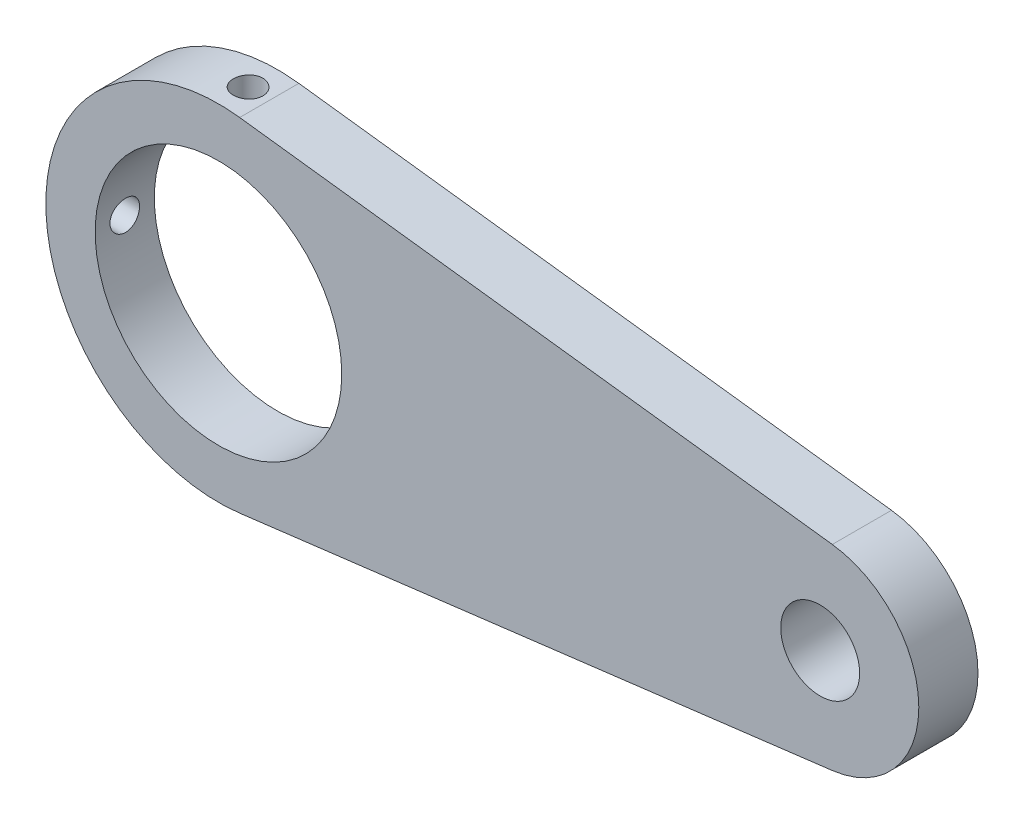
ISO-10303-21;
HEADER;
FILE_DESCRIPTION(('STEP AP214'),'2;1');
FILE_NAME('part.step','',(''),(''),'','','');
FILE_SCHEMA(('AUTOMOTIVE_DESIGN { 1 0 10303 214 1 1 1 1 }'));
ENDSEC;
DATA;
#1=APPLICATION_CONTEXT('core data for automotive mechanical design processes');
#2=APPLICATION_PROTOCOL_DEFINITION('international standard','automotive_design',2000,#1);
#3=PRODUCT_CONTEXT('',#1,'mechanical');
#4=PRODUCT('Part','Part','',(#3));
#5=PRODUCT_RELATED_PRODUCT_CATEGORY('part','',(#4));
#6=PRODUCT_DEFINITION_FORMATION('','',#4);
#7=PRODUCT_DEFINITION_CONTEXT('part definition',#1,'design');
#8=PRODUCT_DEFINITION('design','',#6,#7);
#9=PRODUCT_DEFINITION_SHAPE('','',#8);
#10=(LENGTH_UNIT() NAMED_UNIT(*) SI_UNIT(.MILLI.,.METRE.));
#11=(NAMED_UNIT(*) PLANE_ANGLE_UNIT() SI_UNIT($,.RADIAN.));
#12=(NAMED_UNIT(*) SI_UNIT($,.STERADIAN.) SOLID_ANGLE_UNIT());
#13=UNCERTAINTY_MEASURE_WITH_UNIT(LENGTH_MEASURE(1.E-05),#10,'distance_accuracy_value','');
#14=(GEOMETRIC_REPRESENTATION_CONTEXT(3) GLOBAL_UNCERTAINTY_ASSIGNED_CONTEXT((#13)) GLOBAL_UNIT_ASSIGNED_CONTEXT((#10,
#11,#12)) REPRESENTATION_CONTEXT('',''));
#15=CARTESIAN_POINT('',(0.,0.,0.));
#16=DIRECTION('',(0.,0.,1.));
#17=DIRECTION('',(1.,0.,0.));
#18=AXIS2_PLACEMENT_3D('',#15,#16,#17);
#19=CARTESIAN_POINT('',(0.,0.,12.));
#20=DIRECTION('',(0.,0.,-1.));
#21=DIRECTION('',(-1.,0.,0.));
#22=AXIS2_PLACEMENT_3D('',#19,#20,#21);
#23=CYLINDRICAL_SURFACE('',#22,35.);
#24=CARTESIAN_POINT('',(0.,35.,9.));
#25=CARTESIAN_POINT('',(-0.168180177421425,34.9999983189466,8.99999266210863));
#26=CARTESIAN_POINT('',(-0.336474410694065,34.9987748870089,8.98581013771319));
#27=CARTESIAN_POINT('',(-0.668405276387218,34.9940120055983,8.92944276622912));
#28=CARTESIAN_POINT('',(-0.832036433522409,34.9904699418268,8.8872263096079));
#29=CARTESIAN_POINT('',(-1.14978580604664,34.9814700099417,8.77602193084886));
#30=CARTESIAN_POINT('',(-1.30390939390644,34.9760132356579,8.70704929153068));
#31=CARTESIAN_POINT('',(-1.5983553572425,34.9637955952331,8.54431808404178));
#32=CARTESIAN_POINT('',(-1.7386806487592,34.95703500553,8.45056476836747));
#33=CARTESIAN_POINT('',(-2.00196024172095,34.9429478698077,8.2406617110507));
#34=CARTESIAN_POINT('',(-2.12487233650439,34.9356200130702,8.12445911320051));
#35=CARTESIAN_POINT('',(-2.34947428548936,34.9212352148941,7.87306791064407));
#36=CARTESIAN_POINT('',(-2.45116320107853,34.9141782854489,7.73787846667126));
#37=CARTESIAN_POINT('',(-2.63057608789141,34.901120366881,7.45209423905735));
#38=CARTESIAN_POINT('',(-2.7082627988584,34.895121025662,7.30147598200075));
#39=CARTESIAN_POINT('',(-2.83722803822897,34.8848727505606,6.98927310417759));
#40=CARTESIAN_POINT('',(-2.88850705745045,34.8806237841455,6.82768868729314));
#41=CARTESIAN_POINT('',(-2.96307845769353,34.8743684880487,6.49856435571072));
#42=CARTESIAN_POINT('',(-2.98643979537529,34.8723566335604,6.33104017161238));
#43=CARTESIAN_POINT('',(-3.00472573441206,34.8707859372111,5.99443731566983));
#44=CARTESIAN_POINT('',(-2.99965089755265,34.8712270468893,5.82535867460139));
#45=CARTESIAN_POINT('',(-2.96126551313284,34.874507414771,5.49091935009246));
#46=CARTESIAN_POINT('',(-2.9280299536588,34.8773403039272,5.32554998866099));
#47=CARTESIAN_POINT('',(-2.83438308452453,34.8850750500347,5.00274549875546));
#48=CARTESIAN_POINT('',(-2.77397149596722,34.8899769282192,4.84531045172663));
#49=CARTESIAN_POINT('',(-2.62760362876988,34.9013046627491,4.54260489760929));
#50=CARTESIAN_POINT('',(-2.54161375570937,34.9077325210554,4.39735071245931));
#51=CARTESIAN_POINT('',(-2.34655446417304,34.9213861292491,4.12330862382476));
#52=CARTESIAN_POINT('',(-2.23748455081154,34.9286118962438,3.99452107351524));
#53=CARTESIAN_POINT('',(-1.99894091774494,34.9430754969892,3.75663207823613));
#54=CARTESIAN_POINT('',(-1.86940237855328,34.9503132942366,3.64759561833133));
#55=CARTESIAN_POINT('',(-1.59382461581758,34.9639632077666,3.45280656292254));
#56=CARTESIAN_POINT('',(-1.44778538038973,34.9703753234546,3.36705398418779));
#57=CARTESIAN_POINT('',(-1.1433091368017,34.9816527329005,3.2212707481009));
#58=CARTESIAN_POINT('',(-0.984870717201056,34.9865178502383,3.16124302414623));
#59=CARTESIAN_POINT('',(-0.660113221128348,34.9941511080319,3.06865924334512));
#60=CARTESIAN_POINT('',(-0.493794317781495,34.9969192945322,3.03610258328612));
#61=CARTESIAN_POINT('',(-0.158560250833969,35.0000408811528,2.99946669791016));
#62=CARTESIAN_POINT('',(0.0103450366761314,35.0004018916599,2.99529772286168));
#63=CARTESIAN_POINT('',(0.34645210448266,34.9986887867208,3.01532035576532));
#64=CARTESIAN_POINT('',(0.513653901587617,34.9966146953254,3.03951168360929));
#65=CARTESIAN_POINT('',(0.841351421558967,34.9902695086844,3.11549382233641));
#66=CARTESIAN_POINT('',(1.00185687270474,34.9860017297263,3.16724297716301));
#67=CARTESIAN_POINT('',(1.31190702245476,34.9757485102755,3.29682922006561));
#68=CARTESIAN_POINT('',(1.46145153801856,34.9697630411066,3.37466674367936));
#69=CARTESIAN_POINT('',(1.7457428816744,34.9567262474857,3.55444535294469));
#70=CARTESIAN_POINT('',(1.88045202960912,34.9496723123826,3.65644583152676));
#71=CARTESIAN_POINT('',(2.13086824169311,34.9352996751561,3.88156921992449));
#72=CARTESIAN_POINT('',(2.24657495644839,34.9279809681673,4.00469251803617));
#73=CARTESIAN_POINT('',(2.45601016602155,34.9138810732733,4.26895626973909));
#74=CARTESIAN_POINT('',(2.54968004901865,34.9071013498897,4.41014326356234));
#75=CARTESIAN_POINT('',(2.71198063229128,34.8948680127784,4.70629524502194));
#76=CARTESIAN_POINT('',(2.78061159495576,34.8894143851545,4.8612600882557));
#77=CARTESIAN_POINT('',(2.8907865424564,34.8804590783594,5.18036221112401));
#78=CARTESIAN_POINT('',(2.93236627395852,34.8769548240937,5.34448707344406));
#79=CARTESIAN_POINT('',(2.98737479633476,34.872286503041,5.67742005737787));
#80=CARTESIAN_POINT('',(3.0008041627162,34.871122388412,5.84622808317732));
#81=CARTESIAN_POINT('',(2.99912392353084,34.8712668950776,6.18315306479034));
#82=CARTESIAN_POINT('',(2.98410640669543,34.8725675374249,6.35127049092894));
#83=CARTESIAN_POINT('',(2.92615085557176,34.8774780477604,6.68258592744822));
#84=CARTESIAN_POINT('',(2.88321277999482,34.8810879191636,6.84578393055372));
#85=CARTESIAN_POINT('',(2.7706585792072,34.8902080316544,7.16263302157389));
#86=CARTESIAN_POINT('',(2.70104425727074,34.8957181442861,7.3162847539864));
#87=CARTESIAN_POINT('',(2.53712384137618,34.9080181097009,7.60973557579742));
#88=CARTESIAN_POINT('',(2.4428181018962,34.9148079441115,7.74953486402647));
#89=CARTESIAN_POINT('',(2.23184571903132,34.9289284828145,8.01178384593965));
#90=CARTESIAN_POINT('',(2.11511080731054,34.9362607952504,8.13417853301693));
#91=CARTESIAN_POINT('',(1.86271960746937,34.9506254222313,8.357688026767));
#92=CARTESIAN_POINT('',(1.72705875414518,34.9576576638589,8.45879768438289));
#93=CARTESIAN_POINT('',(1.44039065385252,34.9706432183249,8.63701082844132));
#94=CARTESIAN_POINT('',(1.28935405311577,34.9765944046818,8.71406721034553));
#95=CARTESIAN_POINT('',(0.976537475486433,34.9867226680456,8.84162677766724));
#96=CARTESIAN_POINT('',(0.81477005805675,34.9909017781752,8.89216040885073));
#97=CARTESIAN_POINT('',(0.543377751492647,34.9959451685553,8.95240549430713));
#98=CARTESIAN_POINT('',(0.435496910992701,34.9974587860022,8.97022962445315));
#99=CARTESIAN_POINT('',(0.218426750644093,34.9994867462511,8.99402924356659));
#100=CARTESIAN_POINT('',(0.109237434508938,35.0000010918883,9.00000476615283));
#101=CARTESIAN_POINT('',(0.,35.,9.));
#102=B_SPLINE_CURVE_WITH_KNOTS('',3,(#24,#25,#26,#27,#28,#29,#30,#31,#32,#33,#34,#35,#36,#37,
#38,#39,#40,#41,#42,#43,#44,#45,#46,#47,#48,#49,#50,#51,#52,#53,#54,#55,#56,#57,#58,#59,#60,#61,
#62,#63,#64,#65,#66,#67,#68,#69,#70,#71,#72,#73,#74,#75,#76,#77,#78,#79,#80,#81,#82,#83,#84,#85,
#86,#87,#88,#89,#90,#91,#92,#93,#94,#95,#96,#97,#98,#99,#100,#101),.UNSPECIFIED.,.T.,.F.,(4,2,2,
2,2,2,2,2,2,2,2,2,2,2,2,2,2,2,2,2,2,2,2,2,2,2,2,2,2,2,2,2,2,2,2,2,2,2,4),(0.,0.504141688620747,
1.00885278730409,1.51327602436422,2.01759242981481,2.5231110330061,3.02865198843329,
3.53497383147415,4.04128626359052,4.54634550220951,5.05139476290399,5.55510335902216,
6.05881712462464,6.56319540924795,7.06758450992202,7.57360414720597,8.07962414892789,
8.58570183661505,9.09176841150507,9.59623427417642,10.1006951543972,10.6043956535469,
11.1081045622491,11.6130646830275,12.1180340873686,12.6243317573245,13.1306241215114,
13.636246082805,14.1418577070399,14.6458353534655,15.1498137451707,15.6537580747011,
16.1576951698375,16.6631911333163,17.1688092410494,17.6754113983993,18.1814307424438,
18.5088849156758,18.8363381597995),.UNSPECIFIED.);
#103=CARTESIAN_POINT('',(0.,35.,9.));
#104=VERTEX_POINT('',#103);
#105=EDGE_CURVE('E121',#104,#104,#102,.T.);
#106=ORIENTED_EDGE('',*,*,#105,.T.);
#107=EDGE_LOOP('',(#106));
#108=FACE_BOUND('',#107,.T.);
#109=CARTESIAN_POINT('',(0.,0.,0.));
#110=DIRECTION('',(0.,0.,1.));
#111=DIRECTION('',(1.,0.,0.));
#112=AXIS2_PLACEMENT_3D('',#109,#110,#111);
#113=CIRCLE('',#112,35.);
#114=CARTESIAN_POINT('',(4.3032786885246,34.7344467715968,0.));
#115=VERTEX_POINT('',#114);
#116=CARTESIAN_POINT('',(4.30327868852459,-34.7344467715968,0.));
#117=VERTEX_POINT('',#116);
#118=EDGE_CURVE('E108',#115,#117,#113,.T.);
#119=ORIENTED_EDGE('',*,*,#118,.T.);
#120=DIRECTION('',(0.,0.,-1.));
#121=VECTOR('',#120,1.);
#122=CARTESIAN_POINT('',(4.30327868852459,-34.7344467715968,12.));
#123=LINE('',#122,#121);
#124=CARTESIAN_POINT('',(4.30327868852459,-34.7344467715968,12.));
#125=VERTEX_POINT('',#124);
#126=EDGE_CURVE('E11',#125,#117,#123,.T.);
#127=ORIENTED_EDGE('',*,*,#126,.F.);
#128=CARTESIAN_POINT('',(0.,0.,12.));
#129=DIRECTION('',(0.,0.,1.));
#130=DIRECTION('',(1.,0.,0.));
#131=AXIS2_PLACEMENT_3D('',#128,#129,#130);
#132=CIRCLE('',#131,35.);
#133=CARTESIAN_POINT('',(4.3032786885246,34.7344467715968,12.));
#134=VERTEX_POINT('',#133);
#135=EDGE_CURVE('E95',#134,#125,#132,.T.);
#136=ORIENTED_EDGE('',*,*,#135,.F.);
#137=DIRECTION('',(0.,0.,-1.));
#138=VECTOR('',#137,1.);
#139=CARTESIAN_POINT('',(4.3032786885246,34.7344467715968,12.));
#140=LINE('',#139,#138);
#141=EDGE_CURVE('E104',#134,#115,#140,.T.);
#142=ORIENTED_EDGE('',*,*,#141,.T.);
#143=EDGE_LOOP('',(#119,#127,#136,#142));
#144=FACE_BOUND('',#143,.T.);
#145=CARTESIAN_POINT('',(-35.,0.,9.));
#146=CARTESIAN_POINT('',(-34.9999983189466,0.168180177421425,8.99999266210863));
#147=CARTESIAN_POINT('',(-34.9987748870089,0.336474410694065,8.98581013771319));
#148=CARTESIAN_POINT('',(-34.9940120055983,0.668405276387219,8.92944276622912));
#149=CARTESIAN_POINT('',(-34.9904699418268,0.83203643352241,8.8872263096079));
#150=CARTESIAN_POINT('',(-34.9814700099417,1.14978580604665,8.77602193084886));
#151=CARTESIAN_POINT('',(-34.9760132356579,1.30390939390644,8.70704929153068));
#152=CARTESIAN_POINT('',(-34.9637955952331,1.5983553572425,8.54431808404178));
#153=CARTESIAN_POINT('',(-34.95703500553,1.7386806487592,8.45056476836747));
#154=CARTESIAN_POINT('',(-34.9429478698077,2.00196024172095,8.2406617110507));
#155=CARTESIAN_POINT('',(-34.9356200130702,2.12487233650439,8.12445911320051));
#156=CARTESIAN_POINT('',(-34.9212352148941,2.34947428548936,7.87306791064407));
#157=CARTESIAN_POINT('',(-34.9141782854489,2.45116320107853,7.73787846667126));
#158=CARTESIAN_POINT('',(-34.901120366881,2.63057608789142,7.45209423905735));
#159=CARTESIAN_POINT('',(-34.895121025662,2.70826279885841,7.30147598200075));
#160=CARTESIAN_POINT('',(-34.8848727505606,2.83722803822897,6.98927310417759));
#161=CARTESIAN_POINT('',(-34.8806237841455,2.88850705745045,6.82768868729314));
#162=CARTESIAN_POINT('',(-34.8743684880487,2.96307845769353,6.49856435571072));
#163=CARTESIAN_POINT('',(-34.8723566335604,2.98643979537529,6.33104017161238));
#164=CARTESIAN_POINT('',(-34.8707859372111,3.00472573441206,5.99443731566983));
#165=CARTESIAN_POINT('',(-34.8712270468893,2.99965089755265,5.82535867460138));
#166=CARTESIAN_POINT('',(-34.874507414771,2.96126551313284,5.49091935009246));
#167=CARTESIAN_POINT('',(-34.8773403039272,2.92802995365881,5.32554998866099));
#168=CARTESIAN_POINT('',(-34.8850750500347,2.83438308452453,5.00274549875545));
#169=CARTESIAN_POINT('',(-34.8899769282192,2.77397149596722,4.84531045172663));
#170=CARTESIAN_POINT('',(-34.9013046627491,2.62760362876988,4.54260489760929));
#171=CARTESIAN_POINT('',(-34.9077325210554,2.54161375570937,4.39735071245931));
#172=CARTESIAN_POINT('',(-34.9213861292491,2.34655446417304,4.12330862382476));
#173=CARTESIAN_POINT('',(-34.9286118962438,2.23748455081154,3.99452107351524));
#174=CARTESIAN_POINT('',(-34.9430754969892,1.99894091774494,3.75663207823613));
#175=CARTESIAN_POINT('',(-34.9503132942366,1.86940237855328,3.64759561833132));
#176=CARTESIAN_POINT('',(-34.9639632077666,1.59382461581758,3.45280656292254));
#177=CARTESIAN_POINT('',(-34.9703753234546,1.44778538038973,3.36705398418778));
#178=CARTESIAN_POINT('',(-34.9816527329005,1.1433091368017,3.2212707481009));
#179=CARTESIAN_POINT('',(-34.9865178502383,0.984870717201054,3.16124302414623));
#180=CARTESIAN_POINT('',(-34.9941511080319,0.660113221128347,3.06865924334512));
#181=CARTESIAN_POINT('',(-34.9969192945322,0.493794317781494,3.03610258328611));
#182=CARTESIAN_POINT('',(-35.0000408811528,0.158560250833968,2.99946669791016));
#183=CARTESIAN_POINT('',(-35.0004018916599,-0.0103450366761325,2.99529772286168));
#184=CARTESIAN_POINT('',(-34.9986887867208,-0.346452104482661,3.01532035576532));
#185=CARTESIAN_POINT('',(-34.9966146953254,-0.513653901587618,3.03951168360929));
#186=CARTESIAN_POINT('',(-34.9902695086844,-0.841351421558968,3.11549382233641));
#187=CARTESIAN_POINT('',(-34.9860017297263,-1.00185687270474,3.16724297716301));
#188=CARTESIAN_POINT('',(-34.9757485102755,-1.31190702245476,3.29682922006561));
#189=CARTESIAN_POINT('',(-34.9697630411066,-1.46145153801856,3.37466674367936));
#190=CARTESIAN_POINT('',(-34.9567262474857,-1.7457428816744,3.55444535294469));
#191=CARTESIAN_POINT('',(-34.9496723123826,-1.88045202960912,3.65644583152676));
#192=CARTESIAN_POINT('',(-34.9352996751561,-2.13086824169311,3.88156921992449));
#193=CARTESIAN_POINT('',(-34.9279809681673,-2.2465749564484,4.00469251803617));
#194=CARTESIAN_POINT('',(-34.9138810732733,-2.45601016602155,4.26895626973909));
#195=CARTESIAN_POINT('',(-34.9071013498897,-2.54968004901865,4.41014326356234));
#196=CARTESIAN_POINT('',(-34.8948680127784,-2.71198063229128,4.70629524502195));
#197=CARTESIAN_POINT('',(-34.8894143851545,-2.78061159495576,4.8612600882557));
#198=CARTESIAN_POINT('',(-34.8804590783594,-2.8907865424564,5.18036221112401));
#199=CARTESIAN_POINT('',(-34.8769548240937,-2.93236627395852,5.34448707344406));
#200=CARTESIAN_POINT('',(-34.872286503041,-2.98737479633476,5.67742005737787));
#201=CARTESIAN_POINT('',(-34.871122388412,-3.00080416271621,5.84622808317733));
#202=CARTESIAN_POINT('',(-34.8712668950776,-2.99912392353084,6.18315306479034));
#203=CARTESIAN_POINT('',(-34.8725675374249,-2.98410640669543,6.35127049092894));
#204=CARTESIAN_POINT('',(-34.8774780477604,-2.92615085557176,6.68258592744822));
#205=CARTESIAN_POINT('',(-34.8810879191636,-2.88321277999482,6.84578393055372));
#206=CARTESIAN_POINT('',(-34.8902080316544,-2.7706585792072,7.16263302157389));
#207=CARTESIAN_POINT('',(-34.8957181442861,-2.70104425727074,7.3162847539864));
#208=CARTESIAN_POINT('',(-34.9080181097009,-2.53712384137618,7.60973557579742));
#209=CARTESIAN_POINT('',(-34.9148079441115,-2.4428181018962,7.74953486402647));
#210=CARTESIAN_POINT('',(-34.9289284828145,-2.23184571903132,8.01178384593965));
#211=CARTESIAN_POINT('',(-34.9362607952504,-2.11511080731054,8.13417853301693));
#212=CARTESIAN_POINT('',(-34.9506254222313,-1.86271960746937,8.357688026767));
#213=CARTESIAN_POINT('',(-34.9576576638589,-1.72705875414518,8.4587976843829));
#214=CARTESIAN_POINT('',(-34.9706432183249,-1.44039065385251,8.63701082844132));
#215=CARTESIAN_POINT('',(-34.9765944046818,-1.28935405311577,8.71406721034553));
#216=CARTESIAN_POINT('',(-34.9867226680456,-0.976537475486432,8.84162677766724));
#217=CARTESIAN_POINT('',(-34.9909017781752,-0.814770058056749,8.89216040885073));
#218=CARTESIAN_POINT('',(-34.9959451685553,-0.543377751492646,8.95240549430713));
#219=CARTESIAN_POINT('',(-34.9974587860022,-0.435496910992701,8.97022962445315));
#220=CARTESIAN_POINT('',(-34.9994867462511,-0.218426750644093,8.99402924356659));
#221=CARTESIAN_POINT('',(-35.0000010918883,-0.109237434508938,9.00000476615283));
#222=CARTESIAN_POINT('',(-35.,0.,9.));
#223=B_SPLINE_CURVE_WITH_KNOTS('',3,(#145,#146,#147,#148,#149,#150,#151,#152,#153,#154,#155,
#156,#157,#158,#159,#160,#161,#162,#163,#164,#165,#166,#167,#168,#169,#170,#171,#172,#173,#174,
#175,#176,#177,#178,#179,#180,#181,#182,#183,#184,#185,#186,#187,#188,#189,#190,#191,#192,#193,
#194,#195,#196,#197,#198,#199,#200,#201,#202,#203,#204,#205,#206,#207,#208,#209,#210,#211,#212,
#213,#214,#215,#216,#217,#218,#219,#220,#221,#222),.UNSPECIFIED.,.T.,.F.,(4,2,2,2,2,2,2,2,2,2,2,
2,2,2,2,2,2,2,2,2,2,2,2,2,2,2,2,2,2,2,2,2,2,2,2,2,2,2,4),(0.,0.504141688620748,1.0088527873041,
1.51327602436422,2.01759242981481,2.5231110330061,3.0286519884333,3.53497383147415,
4.04128626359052,4.54634550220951,5.05139476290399,5.55510335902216,6.05881712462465,
6.56319540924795,7.06758450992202,7.57360414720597,8.07962414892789,8.58570183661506,
9.09176841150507,9.59623427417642,10.1006951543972,10.6043956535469,11.1081045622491,
11.6130646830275,12.1180340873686,12.6243317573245,13.1306241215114,13.636246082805,
14.1418577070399,14.6458353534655,15.1498137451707,15.6537580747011,16.1576951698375,
16.6631911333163,17.1688092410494,17.6754113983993,18.1814307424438,18.5088849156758,
18.8363381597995),.UNSPECIFIED.);
#224=CARTESIAN_POINT('',(-35.,0.,9.));
#225=VERTEX_POINT('',#224);
#226=EDGE_CURVE('E122',#225,#225,#223,.T.);
#227=ORIENTED_EDGE('',*,*,#226,.F.);
#228=EDGE_LOOP('',(#227));
#229=FACE_BOUND('',#228,.T.);
#230=ADVANCED_FACE('F36',(#108,#144,#229),#23,.T.);
#231=CARTESIAN_POINT('',(0.,0.,12.));
#232=DIRECTION('',(0.,0.,-1.));
#233=DIRECTION('',(-1.,0.,0.));
#234=AXIS2_PLACEMENT_3D('',#231,#232,#233);
#235=CYLINDRICAL_SURFACE('',#234,25.);
#236=CARTESIAN_POINT('',(0.,0.,0.));
#237=DIRECTION('',(0.,0.,1.));
#238=DIRECTION('',(1.,0.,0.));
#239=AXIS2_PLACEMENT_3D('',#236,#237,#238);
#240=CIRCLE('',#239,25.);
#241=CARTESIAN_POINT('',(25.,0.,0.));
#242=VERTEX_POINT('',#241);
#243=EDGE_CURVE('E147',#242,#242,#240,.T.);
#244=ORIENTED_EDGE('',*,*,#243,.F.);
#245=EDGE_LOOP('',(#244));
#246=FACE_BOUND('',#245,.T.);
#247=CARTESIAN_POINT('',(0.,0.,12.));
#248=DIRECTION('',(0.,0.,1.));
#249=DIRECTION('',(1.,0.,0.));
#250=AXIS2_PLACEMENT_3D('',#247,#248,#249);
#251=CIRCLE('',#250,25.);
#252=CARTESIAN_POINT('',(25.,0.,12.));
#253=VERTEX_POINT('',#252);
#254=EDGE_CURVE('E111',#253,#253,#251,.T.);
#255=ORIENTED_EDGE('',*,*,#254,.T.);
#256=EDGE_LOOP('',(#255));
#257=FACE_BOUND('',#256,.T.);
#258=CARTESIAN_POINT('',(0.,25.,9.));
#259=CARTESIAN_POINT('',(-0.167864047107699,24.9999977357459,8.99999283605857));
#260=CARTESIAN_POINT('',(-0.33583431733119,24.9982914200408,8.98586334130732));
#261=CARTESIAN_POINT('',(-0.667104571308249,24.991648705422,8.92971893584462));
#262=CARTESIAN_POINT('',(-0.830399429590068,24.9867088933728,8.88767455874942));
#263=CARTESIAN_POINT('',(-1.14747479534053,24.9741559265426,8.77695372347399));
#264=CARTESIAN_POINT('',(-1.30126148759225,24.9665445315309,8.70829479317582));
#265=CARTESIAN_POINT('',(-1.595099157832,24.9494959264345,8.5463312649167));
#266=CARTESIAN_POINT('',(-1.73515256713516,24.9400590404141,8.45303104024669));
#267=CARTESIAN_POINT('',(-1.99829131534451,24.920360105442,8.24392513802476));
#268=CARTESIAN_POINT('',(-2.1212966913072,24.9100945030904,8.12801915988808));
#269=CARTESIAN_POINT('',(-2.34615931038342,24.8899239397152,7.8772070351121));
#270=CARTESIAN_POINT('',(-2.44801549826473,24.8800189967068,7.74229994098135));
#271=CARTESIAN_POINT('',(-2.62798342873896,24.8616560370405,7.45679917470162));
#272=CARTESIAN_POINT('',(-2.7060207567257,24.8532025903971,7.30615827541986));
#273=CARTESIAN_POINT('',(-2.8356605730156,24.8387461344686,6.99379129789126));
#274=CARTESIAN_POINT('',(-2.88726398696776,24.8327430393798,6.8320656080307));
#275=CARTESIAN_POINT('',(-2.96232930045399,24.8239006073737,6.50294714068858));
#276=CARTESIAN_POINT('',(-2.98592577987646,24.8210461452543,6.33558547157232));
#277=CARTESIAN_POINT('',(-3.0047237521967,24.8187777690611,5.99925506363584));
#278=CARTESIAN_POINT('',(-2.99992630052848,24.8193637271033,5.83028638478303));
#279=CARTESIAN_POINT('',(-2.96218316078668,24.8238961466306,5.49647403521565));
#280=CARTESIAN_POINT('',(-2.92938543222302,24.8278249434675,5.33161336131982));
#281=CARTESIAN_POINT('',(-2.83680346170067,24.8385728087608,5.00975297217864));
#282=CARTESIAN_POINT('',(-2.77701871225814,24.8453919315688,4.852753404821));
#283=CARTESIAN_POINT('',(-2.63199980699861,24.8611722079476,4.55061053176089));
#284=CARTESIAN_POINT('',(-2.54670106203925,24.8701387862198,4.40549852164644));
#285=CARTESIAN_POINT('',(-2.35312173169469,24.8891993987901,4.13159278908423));
#286=CARTESIAN_POINT('',(-2.24484017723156,24.8992934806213,4.00279975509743));
#287=CARTESIAN_POINT('',(-2.0075475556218,24.9195503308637,3.76432891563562));
#288=CARTESIAN_POINT('',(-1.87840890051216,24.929713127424,3.65477803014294));
#289=CARTESIAN_POINT('',(-1.60350795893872,24.9489020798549,3.45888847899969));
#290=CARTESIAN_POINT('',(-1.45774563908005,24.9579282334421,3.37254985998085));
#291=CARTESIAN_POINT('',(-1.15363930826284,24.9738318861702,3.22553671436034));
#292=CARTESIAN_POINT('',(-0.995291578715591,24.9807087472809,3.16486980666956));
#293=CARTESIAN_POINT('',(-0.670556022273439,24.991533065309,3.0710212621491));
#294=CARTESIAN_POINT('',(-0.504168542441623,24.9954806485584,3.03783843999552));
#295=CARTESIAN_POINT('',(-0.169174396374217,24.9999852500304,3.00006374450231));
#296=CARTESIAN_POINT('',(-0.000587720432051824,25.0005630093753,2.9952969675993));
#297=CARTESIAN_POINT('',(0.33498206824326,24.9983187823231,3.01402857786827));
#298=CARTESIAN_POINT('',(0.501965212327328,24.9954968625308,3.03752641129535));
#299=CARTESIAN_POINT('',(0.829074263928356,24.9867833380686,3.11197496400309));
#300=CARTESIAN_POINT('',(0.989219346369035,24.9809010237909,3.16284261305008));
#301=CARTESIAN_POINT('',(1.29870539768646,24.9667255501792,3.29050070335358));
#302=CARTESIAN_POINT('',(1.44804602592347,24.9584323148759,3.36729196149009));
#303=CARTESIAN_POINT('',(1.73246717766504,24.9403085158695,3.54504291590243));
#304=CARTESIAN_POINT('',(1.86747628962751,24.9304708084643,3.64611613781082));
#305=CARTESIAN_POINT('',(2.11867625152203,24.9103817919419,3.86940084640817));
#306=CARTESIAN_POINT('',(2.23486641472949,24.9001304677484,3.99161310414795));
#307=CARTESIAN_POINT('',(2.44574795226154,24.8803059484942,4.25447561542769));
#308=CARTESIAN_POINT('',(2.54032363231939,24.8707365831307,4.39521901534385));
#309=CARTESIAN_POINT('',(2.70449314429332,24.8534214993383,4.69069502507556));
#310=CARTESIAN_POINT('',(2.77408744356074,24.8456757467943,4.84542737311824));
#311=CARTESIAN_POINT('',(2.88612996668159,24.8329105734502,5.16411060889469));
#312=CARTESIAN_POINT('',(2.92864420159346,24.8278845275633,5.32803801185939));
#313=CARTESIAN_POINT('',(2.98553272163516,24.8211085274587,5.66076896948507));
#314=CARTESIAN_POINT('',(2.99990820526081,24.8193584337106,5.82957231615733));
#315=CARTESIAN_POINT('',(3.00009033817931,24.819336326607,6.16611272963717));
#316=CARTESIAN_POINT('',(2.98607873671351,24.8210421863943,6.33384972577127));
#317=CARTESIAN_POINT('',(2.93026848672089,24.8276922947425,6.66456678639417));
#318=CARTESIAN_POINT('',(2.88846982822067,24.8326365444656,6.82754684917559));
#319=CARTESIAN_POINT('',(2.77832739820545,24.8451996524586,7.1441045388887));
#320=CARTESIAN_POINT('',(2.70999165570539,24.8528177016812,7.29768499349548));
#321=CARTESIAN_POINT('',(2.5487328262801,24.8698714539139,7.5912277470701));
#322=CARTESIAN_POINT('',(2.45580952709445,24.8793071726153,7.73118992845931));
#323=CARTESIAN_POINT('',(2.24733689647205,24.8990055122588,7.99445294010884));
#324=CARTESIAN_POINT('',(2.1316520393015,24.9092728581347,8.11764610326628));
#325=CARTESIAN_POINT('',(1.88122093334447,24.9294354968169,8.342942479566));
#326=CARTESIAN_POINT('',(1.74647018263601,24.939330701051,8.44504069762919));
#327=CARTESIAN_POINT('',(1.46119322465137,24.9576721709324,8.62555057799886));
#328=CARTESIAN_POINT('',(1.31061323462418,24.966113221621,8.70387772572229));
#329=CARTESIAN_POINT('',(0.998422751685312,24.9805418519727,8.83402376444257));
#330=CARTESIAN_POINT('',(0.836824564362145,24.9865321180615,8.88587169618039));
#331=CARTESIAN_POINT('',(0.561977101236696,24.9939268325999,8.94906342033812));
#332=CARTESIAN_POINT('',(0.450466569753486,24.996193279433,8.96813748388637));
#333=CARTESIAN_POINT('',(0.225986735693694,24.9992306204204,8.99360814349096));
#334=CARTESIAN_POINT('',(0.113017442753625,25.0000015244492,9.00000482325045));
#335=CARTESIAN_POINT('',(0.,25.,9.));
#336=B_SPLINE_CURVE_WITH_KNOTS('',3,(#258,#259,#260,#261,#262,#263,#264,#265,#266,#267,#268,
#269,#270,#271,#272,#273,#274,#275,#276,#277,#278,#279,#280,#281,#282,#283,#284,#285,#286,#287,
#288,#289,#290,#291,#292,#293,#294,#295,#296,#297,#298,#299,#300,#301,#302,#303,#304,#305,#306,
#307,#308,#309,#310,#311,#312,#313,#314,#315,#316,#317,#318,#319,#320,#321,#322,#323,#324,#325,
#326,#327,#328,#329,#330,#331,#332,#333,#334,#335),.UNSPECIFIED.,.T.,.F.,(4,2,2,2,2,2,2,2,2,2,2,
2,2,2,2,2,2,2,2,2,2,2,2,2,2,2,2,2,2,2,2,2,2,2,2,2,2,2,4),(0.,0.503179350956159,1.00689069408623,
1.5102708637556,2.01356175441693,2.51913872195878,3.02474090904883,3.53190689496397,
4.03905511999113,4.54375638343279,5.0484388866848,5.55047092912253,6.05251241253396,
6.55583573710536,7.05918028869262,7.56572944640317,8.07227962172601,8.57898002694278,
9.08565857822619,9.58921522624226,10.0927620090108,10.5947890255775,11.0968318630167,
11.6012692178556,12.1057249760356,12.6128207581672,13.119907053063,13.6257524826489,
14.1315763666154,14.6341719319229,15.1367676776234,15.6392114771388,16.1416596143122,
16.6471952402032,17.1528504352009,17.6602829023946,18.1671576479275,18.5059342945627,
18.8447087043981),.UNSPECIFIED.);
#337=CARTESIAN_POINT('',(0.,25.,9.));
#338=VERTEX_POINT('',#337);
#339=EDGE_CURVE('E116',#338,#338,#336,.T.);
#340=ORIENTED_EDGE('',*,*,#339,.F.);
#341=EDGE_LOOP('',(#340));
#342=FACE_BOUND('',#341,.T.);
#343=CARTESIAN_POINT('',(-25.,0.,9.));
#344=CARTESIAN_POINT('',(-24.9999977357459,0.167864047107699,8.99999283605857));
#345=CARTESIAN_POINT('',(-24.9982914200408,0.335834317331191,8.98586334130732));
#346=CARTESIAN_POINT('',(-24.991648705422,0.66710457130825,8.92971893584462));
#347=CARTESIAN_POINT('',(-24.9867088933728,0.830399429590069,8.88767455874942));
#348=CARTESIAN_POINT('',(-24.9741559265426,1.14747479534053,8.77695372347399));
#349=CARTESIAN_POINT('',(-24.9665445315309,1.30126148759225,8.70829479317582));
#350=CARTESIAN_POINT('',(-24.9494959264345,1.595099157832,8.5463312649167));
#351=CARTESIAN_POINT('',(-24.9400590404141,1.73515256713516,8.45303104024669));
#352=CARTESIAN_POINT('',(-24.920360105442,1.99829131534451,8.24392513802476));
#353=CARTESIAN_POINT('',(-24.9100945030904,2.1212966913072,8.12801915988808));
#354=CARTESIAN_POINT('',(-24.8899239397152,2.34615931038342,7.8772070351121));
#355=CARTESIAN_POINT('',(-24.8800189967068,2.44801549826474,7.74229994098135));
#356=CARTESIAN_POINT('',(-24.8616560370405,2.62798342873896,7.45679917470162));
#357=CARTESIAN_POINT('',(-24.8532025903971,2.7060207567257,7.30615827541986));
#358=CARTESIAN_POINT('',(-24.8387461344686,2.8356605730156,6.99379129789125));
#359=CARTESIAN_POINT('',(-24.8327430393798,2.88726398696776,6.8320656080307));
#360=CARTESIAN_POINT('',(-24.8239006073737,2.96232930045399,6.50294714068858));
#361=CARTESIAN_POINT('',(-24.8210461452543,2.98592577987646,6.33558547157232));
#362=CARTESIAN_POINT('',(-24.8187777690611,3.0047237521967,5.99925506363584));
#363=CARTESIAN_POINT('',(-24.8193637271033,2.99992630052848,5.83028638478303));
#364=CARTESIAN_POINT('',(-24.8238961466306,2.96218316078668,5.49647403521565));
#365=CARTESIAN_POINT('',(-24.8278249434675,2.92938543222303,5.33161336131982));
#366=CARTESIAN_POINT('',(-24.8385728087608,2.83680346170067,5.00975297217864));
#367=CARTESIAN_POINT('',(-24.8453919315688,2.77701871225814,4.852753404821));
#368=CARTESIAN_POINT('',(-24.8611722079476,2.63199980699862,4.55061053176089));
#369=CARTESIAN_POINT('',(-24.8701387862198,2.54670106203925,4.40549852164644));
#370=CARTESIAN_POINT('',(-24.8891993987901,2.35312173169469,4.13159278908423));
#371=CARTESIAN_POINT('',(-24.8992934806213,2.24484017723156,4.00279975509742));
#372=CARTESIAN_POINT('',(-24.9195503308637,2.0075475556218,3.76432891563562));
#373=CARTESIAN_POINT('',(-24.929713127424,1.87840890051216,3.65477803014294));
#374=CARTESIAN_POINT('',(-24.9489020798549,1.60350795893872,3.45888847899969));
#375=CARTESIAN_POINT('',(-24.9579282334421,1.45774563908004,3.37254985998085));
#376=CARTESIAN_POINT('',(-24.9738318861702,1.15363930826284,3.22553671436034));
#377=CARTESIAN_POINT('',(-24.9807087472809,0.99529157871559,3.16486980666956));
#378=CARTESIAN_POINT('',(-24.991533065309,0.670556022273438,3.0710212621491));
#379=CARTESIAN_POINT('',(-24.9954806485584,0.504168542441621,3.03783843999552));
#380=CARTESIAN_POINT('',(-24.9999852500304,0.169174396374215,3.00006374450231));
#381=CARTESIAN_POINT('',(-25.0005630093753,0.000587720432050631,2.9952969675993));
#382=CARTESIAN_POINT('',(-24.9983187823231,-0.334982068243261,3.01402857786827));
#383=CARTESIAN_POINT('',(-24.9954968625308,-0.50196521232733,3.03752641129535));
#384=CARTESIAN_POINT('',(-24.9867833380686,-0.829074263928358,3.11197496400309));
#385=CARTESIAN_POINT('',(-24.9809010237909,-0.989219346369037,3.16284261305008));
#386=CARTESIAN_POINT('',(-24.9667255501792,-1.29870539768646,3.29050070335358));
#387=CARTESIAN_POINT('',(-24.9584323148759,-1.44804602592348,3.36729196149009));
#388=CARTESIAN_POINT('',(-24.9403085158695,-1.73246717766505,3.54504291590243));
#389=CARTESIAN_POINT('',(-24.9304708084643,-1.86747628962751,3.64611613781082));
#390=CARTESIAN_POINT('',(-24.9103817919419,-2.11867625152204,3.86940084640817));
#391=CARTESIAN_POINT('',(-24.9001304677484,-2.23486641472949,3.99161310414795));
#392=CARTESIAN_POINT('',(-24.8803059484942,-2.44574795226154,4.25447561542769));
#393=CARTESIAN_POINT('',(-24.8707365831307,-2.54032363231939,4.39521901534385));
#394=CARTESIAN_POINT('',(-24.8534214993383,-2.70449314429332,4.69069502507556));
#395=CARTESIAN_POINT('',(-24.8456757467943,-2.77408744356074,4.84542737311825));
#396=CARTESIAN_POINT('',(-24.8329105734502,-2.88612996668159,5.1641106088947));
#397=CARTESIAN_POINT('',(-24.8278845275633,-2.92864420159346,5.32803801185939));
#398=CARTESIAN_POINT('',(-24.8211085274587,-2.98553272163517,5.66076896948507));
#399=CARTESIAN_POINT('',(-24.8193584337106,-2.99990820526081,5.82957231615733));
#400=CARTESIAN_POINT('',(-24.819336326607,-3.00009033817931,6.16611272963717));
#401=CARTESIAN_POINT('',(-24.8210421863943,-2.98607873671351,6.33384972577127));
#402=CARTESIAN_POINT('',(-24.8276922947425,-2.93026848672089,6.66456678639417));
#403=CARTESIAN_POINT('',(-24.8326365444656,-2.88846982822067,6.82754684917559));
#404=CARTESIAN_POINT('',(-24.8451996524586,-2.77832739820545,7.1441045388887));
#405=CARTESIAN_POINT('',(-24.8528177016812,-2.70999165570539,7.29768499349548));
#406=CARTESIAN_POINT('',(-24.8698714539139,-2.5487328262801,7.5912277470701));
#407=CARTESIAN_POINT('',(-24.8793071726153,-2.45580952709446,7.73118992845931));
#408=CARTESIAN_POINT('',(-24.8990055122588,-2.24733689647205,7.99445294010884));
#409=CARTESIAN_POINT('',(-24.9092728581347,-2.1316520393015,8.11764610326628));
#410=CARTESIAN_POINT('',(-24.9294354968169,-1.88122093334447,8.342942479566));
#411=CARTESIAN_POINT('',(-24.939330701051,-1.74647018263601,8.44504069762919));
#412=CARTESIAN_POINT('',(-24.9576721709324,-1.46119322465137,8.62555057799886));
#413=CARTESIAN_POINT('',(-24.966113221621,-1.31061323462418,8.70387772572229));
#414=CARTESIAN_POINT('',(-24.9805418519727,-0.998422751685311,8.83402376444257));
#415=CARTESIAN_POINT('',(-24.9865321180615,-0.836824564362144,8.88587169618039));
#416=CARTESIAN_POINT('',(-24.9939268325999,-0.561977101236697,8.94906342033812));
#417=CARTESIAN_POINT('',(-24.996193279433,-0.450466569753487,8.96813748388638));
#418=CARTESIAN_POINT('',(-24.9992306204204,-0.225986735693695,8.99360814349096));
#419=CARTESIAN_POINT('',(-25.0000015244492,-0.113017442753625,9.00000482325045));
#420=CARTESIAN_POINT('',(-25.,0.,9.));
#421=B_SPLINE_CURVE_WITH_KNOTS('',3,(#343,#344,#345,#346,#347,#348,#349,#350,#351,#352,#353,
#354,#355,#356,#357,#358,#359,#360,#361,#362,#363,#364,#365,#366,#367,#368,#369,#370,#371,#372,
#373,#374,#375,#376,#377,#378,#379,#380,#381,#382,#383,#384,#385,#386,#387,#388,#389,#390,#391,
#392,#393,#394,#395,#396,#397,#398,#399,#400,#401,#402,#403,#404,#405,#406,#407,#408,#409,#410,
#411,#412,#413,#414,#415,#416,#417,#418,#419,#420),.UNSPECIFIED.,.T.,.F.,(4,2,2,2,2,2,2,2,2,2,2,
2,2,2,2,2,2,2,2,2,2,2,2,2,2,2,2,2,2,2,2,2,2,2,2,2,2,2,4),(0.,0.50317935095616,1.00689069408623,
1.5102708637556,2.01356175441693,2.51913872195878,3.02474090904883,3.53190689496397,
4.03905511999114,4.54375638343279,5.0484388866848,5.55047092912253,6.05251241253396,
6.55583573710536,7.05918028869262,7.56572944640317,8.07227962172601,8.57898002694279,
9.08565857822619,9.58921522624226,10.0927620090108,10.5947890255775,11.0968318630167,
11.6012692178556,12.1057249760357,12.6128207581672,13.119907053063,13.6257524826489,
14.1315763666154,14.6341719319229,15.1367676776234,15.6392114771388,16.1416596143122,
16.6471952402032,17.1528504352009,17.6602829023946,18.1671576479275,18.5059342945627,
18.8447087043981),.UNSPECIFIED.);
#422=CARTESIAN_POINT('',(-25.,0.,9.));
#423=VERTEX_POINT('',#422);
#424=EDGE_CURVE('E40',#423,#423,#421,.T.);
#425=ORIENTED_EDGE('',*,*,#424,.T.);
#426=EDGE_LOOP('',(#425));
#427=FACE_BOUND('',#426,.T.);
#428=ADVANCED_FACE('F123',(#246,#257,#342,#427),#235,.F.);
#429=CARTESIAN_POINT('',(0.,0.,12.));
#430=DIRECTION('',(0.,0.,1.));
#431=DIRECTION('',(1.,0.,0.));
#432=AXIS2_PLACEMENT_3D('',#429,#430,#431);
#433=PLANE('',#432);
#434=ORIENTED_EDGE('',*,*,#254,.F.);
#435=EDGE_LOOP('',(#434));
#436=FACE_BOUND('',#435,.T.);
#437=ORIENTED_EDGE('',*,*,#135,.T.);
#438=DIRECTION('',(0.992412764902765,0.122950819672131,0.));
#439=VECTOR('',#438,1.);
#440=CARTESIAN_POINT('',(4.30327868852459,-34.7344467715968,12.));
#441=LINE('',#440,#439);
#442=CARTESIAN_POINT('',(124.459016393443,-19.8482552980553,12.));
#443=VERTEX_POINT('',#442);
#444=EDGE_CURVE('E89',#125,#443,#441,.T.);
#445=ORIENTED_EDGE('',*,*,#444,.T.);
#446=CARTESIAN_POINT('',(122.,0.,12.));
#447=DIRECTION('',(0.,0.,1.));
#448=DIRECTION('',(1.,0.,0.));
#449=AXIS2_PLACEMENT_3D('',#446,#447,#448);
#450=CIRCLE('',#449,20.);
#451=CARTESIAN_POINT('',(124.459016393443,19.8482552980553,12.));
#452=VERTEX_POINT('',#451);
#453=EDGE_CURVE('E93',#443,#452,#450,.T.);
#454=ORIENTED_EDGE('',*,*,#453,.T.);
#455=DIRECTION('',(-0.992412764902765,0.122950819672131,0.));
#456=VECTOR('',#455,1.);
#457=CARTESIAN_POINT('',(4.3032786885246,34.7344467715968,12.));
#458=LINE('',#457,#456);
#459=EDGE_CURVE('E59',#452,#134,#458,.T.);
#460=ORIENTED_EDGE('',*,*,#459,.T.);
#461=EDGE_LOOP('',(#437,#445,#454,#460));
#462=FACE_BOUND('',#461,.T.);
#463=CARTESIAN_POINT('',(122.,0.,12.));
#464=DIRECTION('',(0.,0.,1.));
#465=DIRECTION('',(1.,0.,0.));
#466=AXIS2_PLACEMENT_3D('',#463,#464,#465);
#467=CIRCLE('',#466,8.00000000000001);
#468=CARTESIAN_POINT('',(130.,0.,12.));
#469=VERTEX_POINT('',#468);
#470=EDGE_CURVE('E144',#469,#469,#467,.T.);
#471=ORIENTED_EDGE('',*,*,#470,.F.);
#472=EDGE_LOOP('',(#471));
#473=FACE_BOUND('',#472,.T.);
#474=ADVANCED_FACE('F90',(#436,#462,#473),#433,.T.);
#475=CARTESIAN_POINT('',(0.,0.,0.));
#476=DIRECTION('',(0.,0.,1.));
#477=DIRECTION('',(1.,0.,0.));
#478=AXIS2_PLACEMENT_3D('',#475,#476,#477);
#479=PLANE('',#478);
#480=ORIENTED_EDGE('',*,*,#118,.F.);
#481=DIRECTION('',(-0.992412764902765,0.122950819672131,0.));
#482=VECTOR('',#481,1.);
#483=CARTESIAN_POINT('',(4.3032786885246,34.7344467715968,0.));
#484=LINE('',#483,#482);
#485=CARTESIAN_POINT('',(124.459016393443,19.8482552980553,0.));
#486=VERTEX_POINT('',#485);
#487=EDGE_CURVE('E82',#486,#115,#484,.T.);
#488=ORIENTED_EDGE('',*,*,#487,.F.);
#489=CARTESIAN_POINT('',(122.,0.,0.));
#490=DIRECTION('',(0.,0.,1.));
#491=DIRECTION('',(1.,0.,0.));
#492=AXIS2_PLACEMENT_3D('',#489,#490,#491);
#493=CIRCLE('',#492,20.);
#494=CARTESIAN_POINT('',(124.459016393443,-19.8482552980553,0.));
#495=VERTEX_POINT('',#494);
#496=EDGE_CURVE('E76',#495,#486,#493,.T.);
#497=ORIENTED_EDGE('',*,*,#496,.F.);
#498=DIRECTION('',(0.992412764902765,0.122950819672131,0.));
#499=VECTOR('',#498,1.);
#500=CARTESIAN_POINT('',(4.30327868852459,-34.7344467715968,0.));
#501=LINE('',#500,#499);
#502=EDGE_CURVE('E99',#117,#495,#501,.T.);
#503=ORIENTED_EDGE('',*,*,#502,.F.);
#504=EDGE_LOOP('',(#480,#488,#497,#503));
#505=FACE_BOUND('',#504,.T.);
#506=ORIENTED_EDGE('',*,*,#243,.T.);
#507=EDGE_LOOP('',(#506));
#508=FACE_BOUND('',#507,.T.);
#509=CARTESIAN_POINT('',(122.,0.,0.));
#510=DIRECTION('',(0.,0.,1.));
#511=DIRECTION('',(1.,0.,0.));
#512=AXIS2_PLACEMENT_3D('',#509,#510,#511);
#513=CIRCLE('',#512,8.00000000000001);
#514=CARTESIAN_POINT('',(130.,0.,0.));
#515=VERTEX_POINT('',#514);
#516=EDGE_CURVE('E141',#515,#515,#513,.T.);
#517=ORIENTED_EDGE('',*,*,#516,.T.);
#518=EDGE_LOOP('',(#517));
#519=FACE_BOUND('',#518,.T.);
#520=ADVANCED_FACE('F155',(#505,#508,#519),#479,.F.);
#521=CARTESIAN_POINT('',(4.30327868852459,-34.7344467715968,12.));
#522=DIRECTION('',(-0.122950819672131,0.992412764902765,0.));
#523=DIRECTION('',(-0.992412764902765,-0.122950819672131,0.));
#524=AXIS2_PLACEMENT_3D('',#521,#522,#523);
#525=PLANE('',#524);
#526=ORIENTED_EDGE('',*,*,#502,.T.);
#527=DIRECTION('',(0.,0.,-1.));
#528=VECTOR('',#527,1.);
#529=CARTESIAN_POINT('',(124.459016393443,-19.8482552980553,12.));
#530=LINE('',#529,#528);
#531=EDGE_CURVE('E50',#443,#495,#530,.T.);
#532=ORIENTED_EDGE('',*,*,#531,.F.);
#533=ORIENTED_EDGE('',*,*,#444,.F.);
#534=ORIENTED_EDGE('',*,*,#126,.T.);
#535=EDGE_LOOP('',(#526,#532,#533,#534));
#536=FACE_BOUND('',#535,.T.);
#537=ADVANCED_FACE('F98',(#536),#525,.F.);
#538=CARTESIAN_POINT('',(122.,0.,12.));
#539=DIRECTION('',(0.,0.,-1.));
#540=DIRECTION('',(-1.,0.,0.));
#541=AXIS2_PLACEMENT_3D('',#538,#539,#540);
#542=CYLINDRICAL_SURFACE('',#541,20.);
#543=ORIENTED_EDGE('',*,*,#496,.T.);
#544=DIRECTION('',(0.,0.,-1.));
#545=VECTOR('',#544,1.);
#546=CARTESIAN_POINT('',(124.459016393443,19.8482552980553,12.));
#547=LINE('',#546,#545);
#548=EDGE_CURVE('E100',#452,#486,#547,.T.);
#549=ORIENTED_EDGE('',*,*,#548,.F.);
#550=ORIENTED_EDGE('',*,*,#453,.F.);
#551=ORIENTED_EDGE('',*,*,#531,.T.);
#552=EDGE_LOOP('',(#543,#549,#550,#551));
#553=FACE_BOUND('',#552,.T.);
#554=ADVANCED_FACE('F102',(#553),#542,.T.);
#555=CARTESIAN_POINT('',(4.3032786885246,34.7344467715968,12.));
#556=DIRECTION('',(-0.122950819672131,-0.992412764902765,0.));
#557=DIRECTION('',(0.992412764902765,-0.122950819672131,0.));
#558=AXIS2_PLACEMENT_3D('',#555,#556,#557);
#559=PLANE('',#558);
#560=ORIENTED_EDGE('',*,*,#487,.T.);
#561=ORIENTED_EDGE('',*,*,#141,.F.);
#562=ORIENTED_EDGE('',*,*,#459,.F.);
#563=ORIENTED_EDGE('',*,*,#548,.T.);
#564=EDGE_LOOP('',(#560,#561,#562,#563));
#565=FACE_BOUND('',#564,.T.);
#566=ADVANCED_FACE('F187',(#565),#559,.F.);
#567=CARTESIAN_POINT('',(122.,0.,12.));
#568=DIRECTION('',(0.,0.,-1.));
#569=DIRECTION('',(-1.,0.,0.));
#570=AXIS2_PLACEMENT_3D('',#567,#568,#569);
#571=CYLINDRICAL_SURFACE('',#570,8.00000000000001);
#572=ORIENTED_EDGE('',*,*,#470,.T.);
#573=EDGE_LOOP('',(#572));
#574=FACE_BOUND('',#573,.T.);
#575=ORIENTED_EDGE('',*,*,#516,.F.);
#576=EDGE_LOOP('',(#575));
#577=FACE_BOUND('',#576,.T.);
#578=ADVANCED_FACE('F131',(#574,#577),#571,.F.);
#579=CARTESIAN_POINT('',(0.,23.,6.));
#580=DIRECTION('',(0.,1.,0.));
#581=DIRECTION('',(0.,0.,1.));
#582=AXIS2_PLACEMENT_3D('',#579,#580,#581);
#583=CYLINDRICAL_SURFACE('',#582,3.);
#584=ORIENTED_EDGE('',*,*,#339,.T.);
#585=EDGE_LOOP('',(#584));
#586=FACE_BOUND('',#585,.T.);
#587=ORIENTED_EDGE('',*,*,#105,.F.);
#588=EDGE_LOOP('',(#587));
#589=FACE_BOUND('',#588,.T.);
#590=ADVANCED_FACE('F127',(#586,#589),#583,.F.);
#591=CARTESIAN_POINT('',(-18.,0.,6.));
#592=DIRECTION('',(-1.,0.,0.));
#593=DIRECTION('',(0.,0.,1.));
#594=AXIS2_PLACEMENT_3D('',#591,#592,#593);
#595=CYLINDRICAL_SURFACE('',#594,3.);
#596=ORIENTED_EDGE('',*,*,#424,.F.);
#597=EDGE_LOOP('',(#596));
#598=FACE_BOUND('',#597,.T.);
#599=ORIENTED_EDGE('',*,*,#226,.T.);
#600=EDGE_LOOP('',(#599));
#601=FACE_BOUND('',#600,.T.);
#602=ADVANCED_FACE('F130',(#598,#601),#595,.F.);
#603=CLOSED_SHELL('',(#230,#428,#474,#520,#537,#554,#566,#578,#590,#602));
#604=MANIFOLD_SOLID_BREP('B2',#603);
#605=ADVANCED_BREP_SHAPE_REPRESENTATION('',(#18,#604),#14);
#606=SHAPE_DEFINITION_REPRESENTATION(#9,#605);
ENDSEC;
END-ISO-10303-21;
